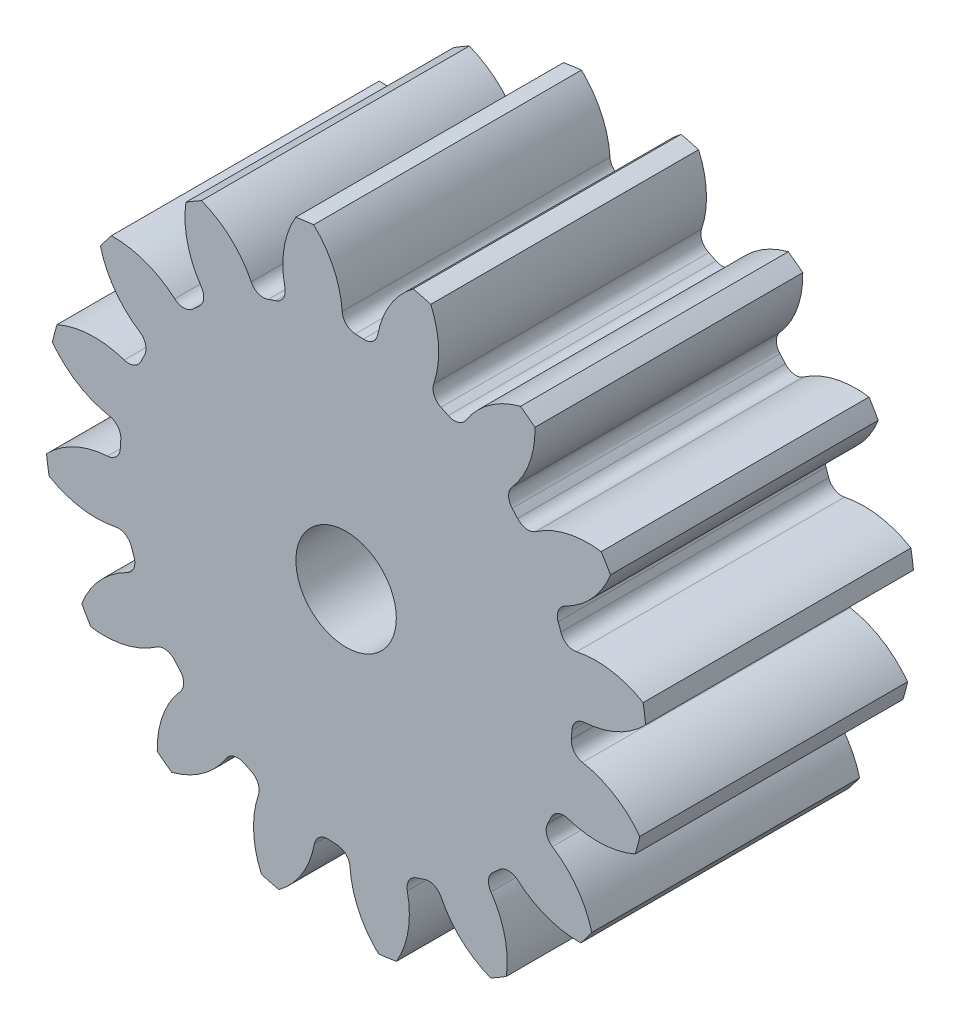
from build123d import *

# Parameters (mm, degrees)
SKETCH3_R         = 114.3
GEARBODY_DEPTH    = 101.6
TOOTHCUT_DEPTH    = 191.922864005
CIRPATTERN1_COUNT = 16
BOREDIA_R         = 19.05
BORE_DEPTH        = 12700


with BuildPart() as part:
    # Sketch3 → gearBody (new body)
    with BuildSketch(Plane.XY):
        Circle(SKETCH3_R)
    extrude(amount=GEARBODY_DEPTH)

    # Sketch2 → toothCut (cut, through all)
    with BuildSketch(Plane.XY):
        with BuildLine():
            ThreePointArc((85.475000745, -6.542161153), (85.578781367, -5.004778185), (85.65491233, -3.465778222))
            ThreePointArc((85.65491233, -3.465778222), (87.12015572, -0.064801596), (90.484243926, 1.483258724))
            ThreePointArc((90.484243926, 1.483258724), (103.520198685, 4.923627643), (114.3, 13.021043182))
            ThreePointArc((114.3, 13.021043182), (114.843067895, -6.716198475), (112.003042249, -26.255591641))
            ThreePointArc((112.003042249, -26.255591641), (102.240595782, -16.956833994), (89.694529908, -12.020389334))
            ThreePointArc((89.694529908, -12.020389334), (86.533822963, -10.090749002), (85.475000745, -6.542161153))
        make_face()
    toothcut = extrude(amount=TOOTHCUT_DEPTH, mode=Mode.SUBTRACT)

    # CirPattern1: toothCut ×16 about axis
    cirpattern1_axis = Axis((0, 0, 0), (0, 0, 1))
    for i in range(1, CIRPATTERN1_COUNT):
        add(toothcut.rotate(cirpattern1_axis, i * 360 / CIRPATTERN1_COUNT), mode=Mode.SUBTRACT)

    # boreDia → bore (cut, symmetric)
    with BuildSketch(Plane.XY):
        Circle(BOREDIA_R)
    extrude(amount=BORE_DEPTH, both=True, mode=Mode.SUBTRACT)


solid = part.part
